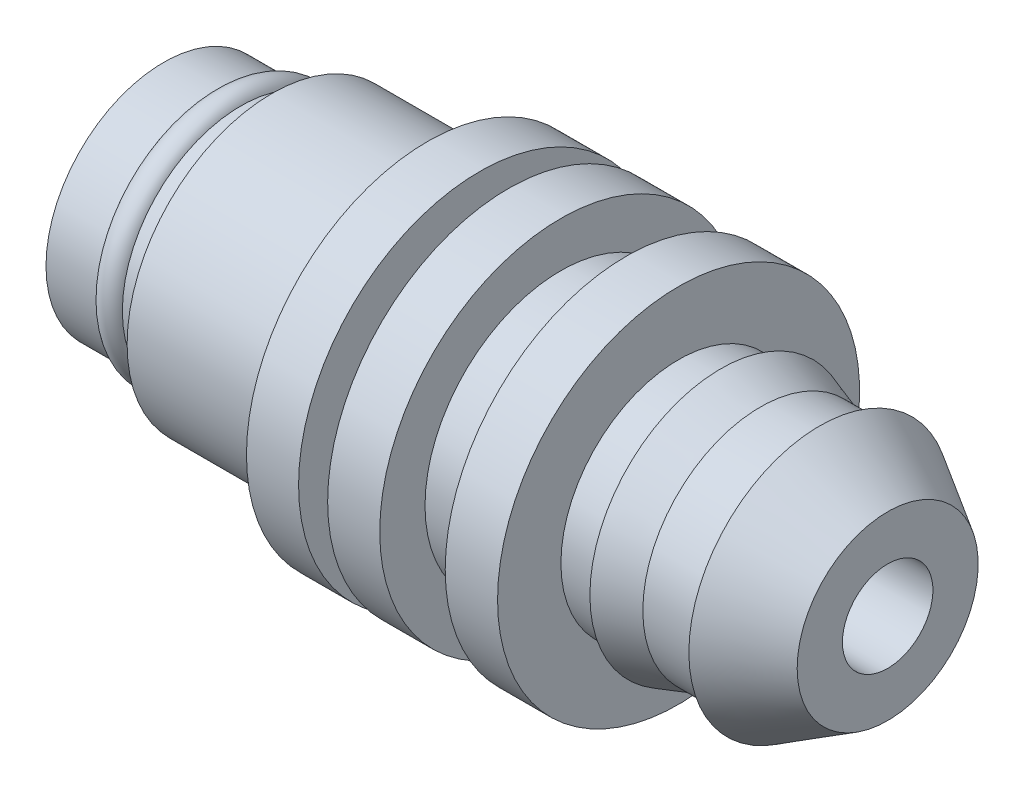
ISO-10303-21;
HEADER;
FILE_DESCRIPTION(('STEP AP214'),'2;1');
FILE_NAME('part.step','',(''),(''),'','','');
FILE_SCHEMA(('AUTOMOTIVE_DESIGN { 1 0 10303 214 1 1 1 1 }'));
ENDSEC;
DATA;
#1=APPLICATION_CONTEXT('core data for automotive mechanical design processes');
#2=APPLICATION_PROTOCOL_DEFINITION('international standard','automotive_design',2000,#1);
#3=PRODUCT_CONTEXT('',#1,'mechanical');
#4=PRODUCT('Part','Part','',(#3));
#5=PRODUCT_RELATED_PRODUCT_CATEGORY('part','',(#4));
#6=PRODUCT_DEFINITION_FORMATION('','',#4);
#7=PRODUCT_DEFINITION_CONTEXT('part definition',#1,'design');
#8=PRODUCT_DEFINITION('design','',#6,#7);
#9=PRODUCT_DEFINITION_SHAPE('','',#8);
#10=(LENGTH_UNIT() NAMED_UNIT(*) SI_UNIT(.MILLI.,.METRE.));
#11=(NAMED_UNIT(*) PLANE_ANGLE_UNIT() SI_UNIT($,.RADIAN.));
#12=(NAMED_UNIT(*) SI_UNIT($,.STERADIAN.) SOLID_ANGLE_UNIT());
#13=UNCERTAINTY_MEASURE_WITH_UNIT(LENGTH_MEASURE(1.E-05),#10,'distance_accuracy_value','');
#14=(GEOMETRIC_REPRESENTATION_CONTEXT(3) GLOBAL_UNCERTAINTY_ASSIGNED_CONTEXT((#13)) GLOBAL_UNIT_ASSIGNED_CONTEXT((#10,
#11,#12)) REPRESENTATION_CONTEXT('',''));
#15=CARTESIAN_POINT('',(0.,0.,0.));
#16=DIRECTION('',(0.,0.,1.));
#17=DIRECTION('',(1.,0.,0.));
#18=AXIS2_PLACEMENT_3D('',#15,#16,#17);
#19=CARTESIAN_POINT('',(12.582247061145,0.,0.));
#20=DIRECTION('',(-1.,0.,0.));
#21=DIRECTION('',(0.,0.,1.));
#22=AXIS2_PLACEMENT_3D('',#19,#20,#21);
#23=CYLINDRICAL_SURFACE('',#22,2.5);
#24=CARTESIAN_POINT('',(52.582247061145,0.,0.));
#25=DIRECTION('',(-1.,0.,0.));
#26=DIRECTION('',(0.,0.,1.));
#27=AXIS2_PLACEMENT_3D('',#24,#25,#26);
#28=CIRCLE('',#27,2.5);
#29=CARTESIAN_POINT('',(52.582247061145,0.,2.5));
#30=VERTEX_POINT('',#29);
#31=EDGE_CURVE('E92',#30,#30,#28,.T.);
#32=ORIENTED_EDGE('',*,*,#31,.F.);
#33=EDGE_LOOP('',(#32));
#34=FACE_BOUND('',#33,.T.);
#35=CARTESIAN_POINT('',(12.582247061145,0.,0.));
#36=DIRECTION('',(-1.,0.,0.));
#37=DIRECTION('',(0.,0.,1.));
#38=AXIS2_PLACEMENT_3D('',#35,#36,#37);
#39=CIRCLE('',#38,2.5);
#40=CARTESIAN_POINT('',(12.582247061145,0.,2.5));
#41=VERTEX_POINT('',#40);
#42=EDGE_CURVE('E8',#41,#41,#39,.T.);
#43=ORIENTED_EDGE('',*,*,#42,.T.);
#44=EDGE_LOOP('',(#43));
#45=FACE_BOUND('',#44,.T.);
#46=ADVANCED_FACE('F13',(#34,#45),#23,.F.);
#47=CARTESIAN_POINT('',(12.582247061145,2.5,0.));
#48=DIRECTION('',(1.,0.,0.));
#49=DIRECTION('',(0.,0.,-1.));
#50=AXIS2_PLACEMENT_3D('',#47,#48,#49);
#51=PLANE('',#50);
#52=ORIENTED_EDGE('',*,*,#42,.F.);
#53=EDGE_LOOP('',(#52));
#54=FACE_BOUND('',#53,.T.);
#55=CARTESIAN_POINT('',(12.582247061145,0.,0.));
#56=DIRECTION('',(-1.,0.,0.));
#57=DIRECTION('',(0.,0.,1.));
#58=AXIS2_PLACEMENT_3D('',#55,#56,#57);
#59=CIRCLE('',#58,6.5);
#60=CARTESIAN_POINT('',(12.582247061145,0.,6.5));
#61=VERTEX_POINT('',#60);
#62=EDGE_CURVE('E19',#61,#61,#59,.T.);
#63=ORIENTED_EDGE('',*,*,#62,.T.);
#64=EDGE_LOOP('',(#63));
#65=FACE_BOUND('',#64,.T.);
#66=ADVANCED_FACE('F99',(#54,#65),#51,.F.);
#67=CARTESIAN_POINT('',(12.582247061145,0.,0.));
#68=DIRECTION('',(-1.,0.,0.));
#69=DIRECTION('',(0.,0.,1.));
#70=AXIS2_PLACEMENT_3D('',#67,#68,#69);
#71=CYLINDRICAL_SURFACE('',#70,6.5);
#72=ORIENTED_EDGE('',*,*,#62,.F.);
#73=EDGE_LOOP('',(#72));
#74=FACE_BOUND('',#73,.T.);
#75=CARTESIAN_POINT('',(15.4182377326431,0.,0.));
#76=DIRECTION('',(-1.,0.,0.));
#77=DIRECTION('',(0.,0.,1.));
#78=AXIS2_PLACEMENT_3D('',#75,#76,#77);
#79=CIRCLE('',#78,6.5);
#80=CARTESIAN_POINT('',(15.4182377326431,0.,6.5));
#81=VERTEX_POINT('',#80);
#82=EDGE_CURVE('E23',#81,#81,#79,.T.);
#83=ORIENTED_EDGE('',*,*,#82,.T.);
#84=EDGE_LOOP('',(#83));
#85=FACE_BOUND('',#84,.T.);
#86=ADVANCED_FACE('F105',(#74,#85),#71,.T.);
#87=CARTESIAN_POINT('',(16.1467752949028,0.,0.));
#88=DIRECTION('',(-1.,0.,0.));
#89=DIRECTION('',(0.,0.,1.));
#90=AXIS2_PLACEMENT_3D('',#87,#88,#89);
#91=TOROIDAL_SURFACE('',#90,6.17291713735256,0.79859262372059);
#92=ORIENTED_EDGE('',*,*,#82,.F.);
#93=EDGE_LOOP('',(#92));
#94=FACE_BOUND('',#93,.T.);
#95=CARTESIAN_POINT('',(16.8505551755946,0.,0.));
#96=DIRECTION('',(-1.,0.,0.));
#97=DIRECTION('',(0.,0.,1.));
#98=AXIS2_PLACEMENT_3D('',#95,#96,#97);
#99=CIRCLE('',#98,6.550334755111);
#100=CARTESIAN_POINT('',(16.8505551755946,0.,6.550334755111));
#101=VERTEX_POINT('',#100);
#102=EDGE_CURVE('E27',#101,#101,#99,.T.);
#103=ORIENTED_EDGE('',*,*,#102,.T.);
#104=EDGE_LOOP('',(#103));
#105=FACE_BOUND('',#104,.T.);
#106=ADVANCED_FACE('F111',(#94,#105),#91,.T.);
#107=CARTESIAN_POINT('',(12.582247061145,0.,0.));
#108=DIRECTION('',(-1.,0.,0.));
#109=DIRECTION('',(0.,0.,1.));
#110=AXIS2_PLACEMENT_3D('',#107,#108,#109);
#111=CYLINDRICAL_SURFACE('',#110,6.550334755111);
#112=ORIENTED_EDGE('',*,*,#102,.F.);
#113=EDGE_LOOP('',(#112));
#114=FACE_BOUND('',#113,.T.);
#115=CARTESIAN_POINT('',(18.5631553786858,0.,0.));
#116=DIRECTION('',(-1.,0.,0.));
#117=DIRECTION('',(0.,0.,1.));
#118=AXIS2_PLACEMENT_3D('',#115,#116,#117);
#119=CIRCLE('',#118,6.550334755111);
#120=CARTESIAN_POINT('',(18.5631553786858,0.,6.550334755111));
#121=VERTEX_POINT('',#120);
#122=EDGE_CURVE('E32',#121,#121,#119,.T.);
#123=ORIENTED_EDGE('',*,*,#122,.T.);
#124=EDGE_LOOP('',(#123));
#125=FACE_BOUND('',#124,.T.);
#126=ADVANCED_FACE('F117',(#114,#125),#111,.T.);
#127=CARTESIAN_POINT('',(18.5631553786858,6.550334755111,0.));
#128=DIRECTION('',(1.,0.,0.));
#129=DIRECTION('',(0.,0.,-1.));
#130=AXIS2_PLACEMENT_3D('',#127,#128,#129);
#131=PLANE('',#130);
#132=ORIENTED_EDGE('',*,*,#122,.F.);
#133=EDGE_LOOP('',(#132));
#134=FACE_BOUND('',#133,.T.);
#135=CARTESIAN_POINT('',(18.5631553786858,0.,0.));
#136=DIRECTION('',(-1.,0.,0.));
#137=DIRECTION('',(0.,0.,1.));
#138=AXIS2_PLACEMENT_3D('',#135,#136,#137);
#139=CIRCLE('',#138,8.);
#140=CARTESIAN_POINT('',(18.5631553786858,0.,8.));
#141=VERTEX_POINT('',#140);
#142=EDGE_CURVE('E35',#141,#141,#139,.T.);
#143=ORIENTED_EDGE('',*,*,#142,.T.);
#144=EDGE_LOOP('',(#143));
#145=FACE_BOUND('',#144,.T.);
#146=ADVANCED_FACE('F121',(#134,#145),#131,.F.);
#147=CARTESIAN_POINT('',(12.582247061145,0.,0.));
#148=DIRECTION('',(-1.,0.,0.));
#149=DIRECTION('',(0.,0.,1.));
#150=AXIS2_PLACEMENT_3D('',#147,#148,#149);
#151=CYLINDRICAL_SURFACE('',#150,8.);
#152=ORIENTED_EDGE('',*,*,#142,.F.);
#153=EDGE_LOOP('',(#152));
#154=FACE_BOUND('',#153,.T.);
#155=CARTESIAN_POINT('',(27.1570600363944,0.,0.));
#156=DIRECTION('',(-1.,0.,0.));
#157=DIRECTION('',(0.,0.,1.));
#158=AXIS2_PLACEMENT_3D('',#155,#156,#157);
#159=CIRCLE('',#158,8.);
#160=CARTESIAN_POINT('',(27.1570600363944,0.,8.));
#161=VERTEX_POINT('',#160);
#162=EDGE_CURVE('E38',#161,#161,#159,.T.);
#163=ORIENTED_EDGE('',*,*,#162,.T.);
#164=EDGE_LOOP('',(#163));
#165=FACE_BOUND('',#164,.T.);
#166=ADVANCED_FACE('F125',(#154,#165),#151,.T.);
#167=CARTESIAN_POINT('',(27.1570600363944,8.,0.));
#168=DIRECTION('',(1.,0.,0.));
#169=DIRECTION('',(0.,0.,-1.));
#170=AXIS2_PLACEMENT_3D('',#167,#168,#169);
#171=PLANE('',#170);
#172=ORIENTED_EDGE('',*,*,#162,.F.);
#173=EDGE_LOOP('',(#172));
#174=FACE_BOUND('',#173,.T.);
#175=CARTESIAN_POINT('',(27.1570600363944,0.,0.));
#176=DIRECTION('',(-1.,0.,0.));
#177=DIRECTION('',(0.,0.,1.));
#178=AXIS2_PLACEMENT_3D('',#175,#176,#177);
#179=CIRCLE('',#178,10.);
#180=CARTESIAN_POINT('',(27.1570600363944,0.,10.));
#181=VERTEX_POINT('',#180);
#182=EDGE_CURVE('E41',#181,#181,#179,.T.);
#183=ORIENTED_EDGE('',*,*,#182,.T.);
#184=EDGE_LOOP('',(#183));
#185=FACE_BOUND('',#184,.T.);
#186=ADVANCED_FACE('F129',(#174,#185),#171,.F.);
#187=CARTESIAN_POINT('',(12.582247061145,0.,0.));
#188=DIRECTION('',(-1.,0.,0.));
#189=DIRECTION('',(0.,0.,1.));
#190=AXIS2_PLACEMENT_3D('',#187,#188,#189);
#191=CYLINDRICAL_SURFACE('',#190,10.);
#192=ORIENTED_EDGE('',*,*,#182,.F.);
#193=EDGE_LOOP('',(#192));
#194=FACE_BOUND('',#193,.T.);
#195=CARTESIAN_POINT('',(30.0360485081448,0.,0.));
#196=DIRECTION('',(-1.,0.,0.));
#197=DIRECTION('',(0.,0.,1.));
#198=AXIS2_PLACEMENT_3D('',#195,#196,#197);
#199=CIRCLE('',#198,10.);
#200=CARTESIAN_POINT('',(30.0360485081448,0.,10.));
#201=VERTEX_POINT('',#200);
#202=EDGE_CURVE('E44',#201,#201,#199,.T.);
#203=ORIENTED_EDGE('',*,*,#202,.T.);
#204=EDGE_LOOP('',(#203));
#205=FACE_BOUND('',#204,.T.);
#206=ADVANCED_FACE('F133',(#194,#205),#191,.T.);
#207=CARTESIAN_POINT('',(30.0360485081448,10.,0.));
#208=DIRECTION('',(-1.,0.,0.));
#209=DIRECTION('',(0.,0.,1.));
#210=AXIS2_PLACEMENT_3D('',#207,#208,#209);
#211=PLANE('',#210);
#212=ORIENTED_EDGE('',*,*,#202,.F.);
#213=EDGE_LOOP('',(#212));
#214=FACE_BOUND('',#213,.T.);
#215=CARTESIAN_POINT('',(30.0360485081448,0.,0.));
#216=DIRECTION('',(-1.,0.,0.));
#217=DIRECTION('',(0.,0.,1.));
#218=AXIS2_PLACEMENT_3D('',#215,#216,#217);
#219=CIRCLE('',#218,7.5);
#220=CARTESIAN_POINT('',(30.0360485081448,0.,7.5));
#221=VERTEX_POINT('',#220);
#222=EDGE_CURVE('E47',#221,#221,#219,.T.);
#223=ORIENTED_EDGE('',*,*,#222,.T.);
#224=EDGE_LOOP('',(#223));
#225=FACE_BOUND('',#224,.T.);
#226=ADVANCED_FACE('F137',(#214,#225),#211,.F.);
#227=CARTESIAN_POINT('',(12.582247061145,0.,0.));
#228=DIRECTION('',(-1.,0.,0.));
#229=DIRECTION('',(0.,0.,1.));
#230=AXIS2_PLACEMENT_3D('',#227,#228,#229);
#231=CYLINDRICAL_SURFACE('',#230,7.5);
#232=ORIENTED_EDGE('',*,*,#222,.F.);
#233=EDGE_LOOP('',(#232));
#234=FACE_BOUND('',#233,.T.);
#235=CARTESIAN_POINT('',(31.641939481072,0.,0.));
#236=DIRECTION('',(-1.,0.,0.));
#237=DIRECTION('',(0.,0.,1.));
#238=AXIS2_PLACEMENT_3D('',#235,#236,#237);
#239=CIRCLE('',#238,7.5);
#240=CARTESIAN_POINT('',(31.641939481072,0.,7.5));
#241=VERTEX_POINT('',#240);
#242=EDGE_CURVE('E50',#241,#241,#239,.T.);
#243=ORIENTED_EDGE('',*,*,#242,.T.);
#244=EDGE_LOOP('',(#243));
#245=FACE_BOUND('',#244,.T.);
#246=ADVANCED_FACE('F141',(#234,#245),#231,.T.);
#247=CARTESIAN_POINT('',(31.641939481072,10.,0.));
#248=DIRECTION('',(1.,0.,0.));
#249=DIRECTION('',(0.,0.,-1.));
#250=AXIS2_PLACEMENT_3D('',#247,#248,#249);
#251=PLANE('',#250);
#252=ORIENTED_EDGE('',*,*,#242,.F.);
#253=EDGE_LOOP('',(#252));
#254=FACE_BOUND('',#253,.T.);
#255=CARTESIAN_POINT('',(31.641939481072,0.,0.));
#256=DIRECTION('',(-1.,0.,0.));
#257=DIRECTION('',(0.,0.,1.));
#258=AXIS2_PLACEMENT_3D('',#255,#256,#257);
#259=CIRCLE('',#258,10.);
#260=CARTESIAN_POINT('',(31.641939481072,0.,10.));
#261=VERTEX_POINT('',#260);
#262=EDGE_CURVE('E53',#261,#261,#259,.T.);
#263=ORIENTED_EDGE('',*,*,#262,.T.);
#264=EDGE_LOOP('',(#263));
#265=FACE_BOUND('',#264,.T.);
#266=ADVANCED_FACE('F145',(#254,#265),#251,.F.);
#267=CARTESIAN_POINT('',(12.582247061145,0.,0.));
#268=DIRECTION('',(-1.,0.,0.));
#269=DIRECTION('',(0.,0.,1.));
#270=AXIS2_PLACEMENT_3D('',#267,#268,#269);
#271=CYLINDRICAL_SURFACE('',#270,10.);
#272=ORIENTED_EDGE('',*,*,#262,.F.);
#273=EDGE_LOOP('',(#272));
#274=FACE_BOUND('',#273,.T.);
#275=CARTESIAN_POINT('',(34.5209279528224,0.,0.));
#276=DIRECTION('',(-1.,0.,0.));
#277=DIRECTION('',(0.,0.,1.));
#278=AXIS2_PLACEMENT_3D('',#275,#276,#277);
#279=CIRCLE('',#278,10.);
#280=CARTESIAN_POINT('',(34.5209279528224,0.,10.));
#281=VERTEX_POINT('',#280);
#282=EDGE_CURVE('E56',#281,#281,#279,.T.);
#283=ORIENTED_EDGE('',*,*,#282,.T.);
#284=EDGE_LOOP('',(#283));
#285=FACE_BOUND('',#284,.T.);
#286=ADVANCED_FACE('F149',(#274,#285),#271,.T.);
#287=CARTESIAN_POINT('',(34.5209279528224,8.,0.));
#288=DIRECTION('',(-1.,0.,0.));
#289=DIRECTION('',(0.,0.,1.));
#290=AXIS2_PLACEMENT_3D('',#287,#288,#289);
#291=PLANE('',#290);
#292=ORIENTED_EDGE('',*,*,#282,.F.);
#293=EDGE_LOOP('',(#292));
#294=FACE_BOUND('',#293,.T.);
#295=CARTESIAN_POINT('',(34.5209279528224,0.,0.));
#296=DIRECTION('',(-1.,0.,0.));
#297=DIRECTION('',(0.,0.,1.));
#298=AXIS2_PLACEMENT_3D('',#295,#296,#297);
#299=CIRCLE('',#298,7.5);
#300=CARTESIAN_POINT('',(34.5209279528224,0.,7.5));
#301=VERTEX_POINT('',#300);
#302=EDGE_CURVE('E59',#301,#301,#299,.T.);
#303=ORIENTED_EDGE('',*,*,#302,.T.);
#304=EDGE_LOOP('',(#303));
#305=FACE_BOUND('',#304,.T.);
#306=ADVANCED_FACE('F153',(#294,#305),#291,.F.);
#307=CARTESIAN_POINT('',(12.582247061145,0.,0.));
#308=DIRECTION('',(-1.,0.,0.));
#309=DIRECTION('',(0.,0.,1.));
#310=AXIS2_PLACEMENT_3D('',#307,#308,#309);
#311=CYLINDRICAL_SURFACE('',#310,7.5);
#312=ORIENTED_EDGE('',*,*,#302,.F.);
#313=EDGE_LOOP('',(#312));
#314=FACE_BOUND('',#313,.T.);
#315=CARTESIAN_POINT('',(38.1375713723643,0.,0.));
#316=DIRECTION('',(-1.,0.,0.));
#317=DIRECTION('',(0.,0.,1.));
#318=AXIS2_PLACEMENT_3D('',#315,#316,#317);
#319=CIRCLE('',#318,7.5);
#320=CARTESIAN_POINT('',(38.1375713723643,0.,7.5));
#321=VERTEX_POINT('',#320);
#322=EDGE_CURVE('E62',#321,#321,#319,.T.);
#323=ORIENTED_EDGE('',*,*,#322,.T.);
#324=EDGE_LOOP('',(#323));
#325=FACE_BOUND('',#324,.T.);
#326=ADVANCED_FACE('F157',(#314,#325),#311,.T.);
#327=CARTESIAN_POINT('',(38.1375713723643,7.5,0.));
#328=DIRECTION('',(1.,0.,0.));
#329=DIRECTION('',(0.,0.,-1.));
#330=AXIS2_PLACEMENT_3D('',#327,#328,#329);
#331=PLANE('',#330);
#332=ORIENTED_EDGE('',*,*,#322,.F.);
#333=EDGE_LOOP('',(#332));
#334=FACE_BOUND('',#333,.T.);
#335=CARTESIAN_POINT('',(38.1375713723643,0.,0.));
#336=DIRECTION('',(-1.,0.,0.));
#337=DIRECTION('',(0.,0.,1.));
#338=AXIS2_PLACEMENT_3D('',#335,#336,#337);
#339=CIRCLE('',#338,10.);
#340=CARTESIAN_POINT('',(38.1375713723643,0.,10.));
#341=VERTEX_POINT('',#340);
#342=EDGE_CURVE('E65',#341,#341,#339,.T.);
#343=ORIENTED_EDGE('',*,*,#342,.T.);
#344=EDGE_LOOP('',(#343));
#345=FACE_BOUND('',#344,.T.);
#346=ADVANCED_FACE('F161',(#334,#345),#331,.F.);
#347=CARTESIAN_POINT('',(12.582247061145,0.,0.));
#348=DIRECTION('',(-1.,0.,0.));
#349=DIRECTION('',(0.,0.,1.));
#350=AXIS2_PLACEMENT_3D('',#347,#348,#349);
#351=CYLINDRICAL_SURFACE('',#350,10.);
#352=ORIENTED_EDGE('',*,*,#342,.F.);
#353=EDGE_LOOP('',(#352));
#354=FACE_BOUND('',#353,.T.);
#355=CARTESIAN_POINT('',(41.0299972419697,0.,0.));
#356=DIRECTION('',(-1.,0.,0.));
#357=DIRECTION('',(0.,0.,1.));
#358=AXIS2_PLACEMENT_3D('',#355,#356,#357);
#359=CIRCLE('',#358,10.);
#360=CARTESIAN_POINT('',(41.0299972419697,0.,10.));
#361=VERTEX_POINT('',#360);
#362=EDGE_CURVE('E68',#361,#361,#359,.T.);
#363=ORIENTED_EDGE('',*,*,#362,.T.);
#364=EDGE_LOOP('',(#363));
#365=FACE_BOUND('',#364,.T.);
#366=ADVANCED_FACE('F165',(#354,#365),#351,.T.);
#367=CARTESIAN_POINT('',(41.0299972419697,10.,0.));
#368=DIRECTION('',(-1.,0.,0.));
#369=DIRECTION('',(0.,0.,1.));
#370=AXIS2_PLACEMENT_3D('',#367,#368,#369);
#371=PLANE('',#370);
#372=ORIENTED_EDGE('',*,*,#362,.F.);
#373=EDGE_LOOP('',(#372));
#374=FACE_BOUND('',#373,.T.);
#375=CARTESIAN_POINT('',(41.0299972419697,0.,0.));
#376=DIRECTION('',(-1.,0.,0.));
#377=DIRECTION('',(0.,0.,1.));
#378=AXIS2_PLACEMENT_3D('',#375,#376,#377);
#379=CIRCLE('',#378,6.5);
#380=CARTESIAN_POINT('',(41.0299972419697,0.,6.5));
#381=VERTEX_POINT('',#380);
#382=EDGE_CURVE('E71',#381,#381,#379,.T.);
#383=ORIENTED_EDGE('',*,*,#382,.T.);
#384=EDGE_LOOP('',(#383));
#385=FACE_BOUND('',#384,.T.);
#386=ADVANCED_FACE('F169',(#374,#385),#371,.F.);
#387=CARTESIAN_POINT('',(12.582247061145,0.,0.));
#388=DIRECTION('',(-1.,0.,0.));
#389=DIRECTION('',(0.,0.,1.));
#390=AXIS2_PLACEMENT_3D('',#387,#388,#389);
#391=CYLINDRICAL_SURFACE('',#390,6.5);
#392=ORIENTED_EDGE('',*,*,#382,.F.);
#393=EDGE_LOOP('',(#392));
#394=FACE_BOUND('',#393,.T.);
#395=CARTESIAN_POINT('',(43.3569976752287,0.,0.));
#396=DIRECTION('',(-1.,0.,0.));
#397=DIRECTION('',(0.,0.,1.));
#398=AXIS2_PLACEMENT_3D('',#395,#396,#397);
#399=CIRCLE('',#398,6.5);
#400=CARTESIAN_POINT('',(43.3569976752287,0.,6.5));
#401=VERTEX_POINT('',#400);
#402=EDGE_CURVE('E74',#401,#401,#399,.T.);
#403=ORIENTED_EDGE('',*,*,#402,.T.);
#404=EDGE_LOOP('',(#403));
#405=FACE_BOUND('',#404,.T.);
#406=ADVANCED_FACE('F173',(#394,#405),#391,.T.);
#407=CARTESIAN_POINT('',(43.3569976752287,7.22606231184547,0.));
#408=DIRECTION('',(1.,0.,0.));
#409=DIRECTION('',(0.,0.,-1.));
#410=AXIS2_PLACEMENT_3D('',#407,#408,#409);
#411=PLANE('',#410);
#412=ORIENTED_EDGE('',*,*,#402,.F.);
#413=EDGE_LOOP('',(#412));
#414=FACE_BOUND('',#413,.T.);
#415=CARTESIAN_POINT('',(43.3569976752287,0.,0.));
#416=DIRECTION('',(-1.,0.,0.));
#417=DIRECTION('',(0.,0.,1.));
#418=AXIS2_PLACEMENT_3D('',#415,#416,#417);
#419=CIRCLE('',#418,7.22606231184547);
#420=CARTESIAN_POINT('',(43.3569976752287,0.,7.22606231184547));
#421=VERTEX_POINT('',#420);
#422=EDGE_CURVE('E77',#421,#421,#419,.T.);
#423=ORIENTED_EDGE('',*,*,#422,.T.);
#424=EDGE_LOOP('',(#423));
#425=FACE_BOUND('',#424,.T.);
#426=ADVANCED_FACE('F177',(#414,#425),#411,.F.);
#427=CARTESIAN_POINT('',(45.5551859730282,0.,0.));
#428=DIRECTION('',(-1.,0.,0.));
#429=DIRECTION('',(0.,0.,1.));
#430=AXIS2_PLACEMENT_3D('',#427,#428,#429);
#431=CONICAL_SURFACE('',#430,6.5,0.319018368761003);
#432=ORIENTED_EDGE('',*,*,#422,.F.);
#433=EDGE_LOOP('',(#432));
#434=FACE_BOUND('',#433,.T.);
#435=CARTESIAN_POINT('',(45.5551859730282,0.,0.));
#436=DIRECTION('',(-1.,0.,0.));
#437=DIRECTION('',(0.,0.,1.));
#438=AXIS2_PLACEMENT_3D('',#435,#436,#437);
#439=CIRCLE('',#438,6.5);
#440=CARTESIAN_POINT('',(45.5551859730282,0.,6.5));
#441=VERTEX_POINT('',#440);
#442=EDGE_CURVE('E80',#441,#441,#439,.T.);
#443=ORIENTED_EDGE('',*,*,#442,.T.);
#444=EDGE_LOOP('',(#443));
#445=FACE_BOUND('',#444,.T.);
#446=ADVANCED_FACE('F181',(#434,#445),#431,.T.);
#447=CARTESIAN_POINT('',(12.582247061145,0.,0.));
#448=DIRECTION('',(-1.,0.,0.));
#449=DIRECTION('',(0.,0.,1.));
#450=AXIS2_PLACEMENT_3D('',#447,#448,#449);
#451=CYLINDRICAL_SURFACE('',#450,6.5);
#452=ORIENTED_EDGE('',*,*,#442,.F.);
#453=EDGE_LOOP('',(#452));
#454=FACE_BOUND('',#453,.T.);
#455=CARTESIAN_POINT('',(48.8243926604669,0.,0.));
#456=DIRECTION('',(-1.,0.,0.));
#457=DIRECTION('',(0.,0.,1.));
#458=AXIS2_PLACEMENT_3D('',#455,#456,#457);
#459=CIRCLE('',#458,6.5);
#460=CARTESIAN_POINT('',(48.8243926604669,0.,6.5));
#461=VERTEX_POINT('',#460);
#462=EDGE_CURVE('E83',#461,#461,#459,.T.);
#463=ORIENTED_EDGE('',*,*,#462,.T.);
#464=EDGE_LOOP('',(#463));
#465=FACE_BOUND('',#464,.T.);
#466=ADVANCED_FACE('F185',(#454,#465),#451,.T.);
#467=CARTESIAN_POINT('',(48.8243926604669,6.5,0.));
#468=DIRECTION('',(1.,0.,0.));
#469=DIRECTION('',(0.,0.,-1.));
#470=AXIS2_PLACEMENT_3D('',#467,#468,#469);
#471=PLANE('',#470);
#472=ORIENTED_EDGE('',*,*,#462,.F.);
#473=EDGE_LOOP('',(#472));
#474=FACE_BOUND('',#473,.T.);
#475=CARTESIAN_POINT('',(48.8243926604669,0.,0.));
#476=DIRECTION('',(-1.,0.,0.));
#477=DIRECTION('',(0.,0.,1.));
#478=AXIS2_PLACEMENT_3D('',#475,#476,#477);
#479=CIRCLE('',#478,7.22606231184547);
#480=CARTESIAN_POINT('',(48.8243926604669,0.,7.22606231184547));
#481=VERTEX_POINT('',#480);
#482=EDGE_CURVE('E86',#481,#481,#479,.T.);
#483=ORIENTED_EDGE('',*,*,#482,.T.);
#484=EDGE_LOOP('',(#483));
#485=FACE_BOUND('',#484,.T.);
#486=ADVANCED_FACE('F189',(#474,#485),#471,.F.);
#487=CARTESIAN_POINT('',(52.582247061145,0.,0.));
#488=DIRECTION('',(-1.,0.,0.));
#489=DIRECTION('',(0.,0.,1.));
#490=AXIS2_PLACEMENT_3D('',#487,#488,#489);
#491=CONICAL_SURFACE('',#490,5.,0.534794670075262);
#492=ORIENTED_EDGE('',*,*,#482,.F.);
#493=EDGE_LOOP('',(#492));
#494=FACE_BOUND('',#493,.T.);
#495=CARTESIAN_POINT('',(52.582247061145,0.,0.));
#496=DIRECTION('',(-1.,0.,0.));
#497=DIRECTION('',(0.,0.,1.));
#498=AXIS2_PLACEMENT_3D('',#495,#496,#497);
#499=CIRCLE('',#498,5.);
#500=CARTESIAN_POINT('',(52.582247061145,0.,5.));
#501=VERTEX_POINT('',#500);
#502=EDGE_CURVE('E89',#501,#501,#499,.T.);
#503=ORIENTED_EDGE('',*,*,#502,.T.);
#504=EDGE_LOOP('',(#503));
#505=FACE_BOUND('',#504,.T.);
#506=ADVANCED_FACE('F193',(#494,#505),#491,.T.);
#507=CARTESIAN_POINT('',(52.582247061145,5.,0.));
#508=DIRECTION('',(-1.,0.,0.));
#509=DIRECTION('',(0.,0.,1.));
#510=AXIS2_PLACEMENT_3D('',#507,#508,#509);
#511=PLANE('',#510);
#512=ORIENTED_EDGE('',*,*,#502,.F.);
#513=EDGE_LOOP('',(#512));
#514=FACE_BOUND('',#513,.T.);
#515=ORIENTED_EDGE('',*,*,#31,.T.);
#516=EDGE_LOOP('',(#515));
#517=FACE_BOUND('',#516,.T.);
#518=ADVANCED_FACE('F96',(#514,#517),#511,.F.);
#519=CLOSED_SHELL('',(#46,#66,#86,#106,#126,#146,#166,#186,#206,#226,#246,#266,#286,#306,#326,
#346,#366,#386,#406,#426,#446,#466,#486,#506,#518));
#520=MANIFOLD_SOLID_BREP('B1',#519);
#521=ADVANCED_BREP_SHAPE_REPRESENTATION('',(#18,#520),#14);
#522=SHAPE_DEFINITION_REPRESENTATION(#9,#521);
ENDSEC;
END-ISO-10303-21;
